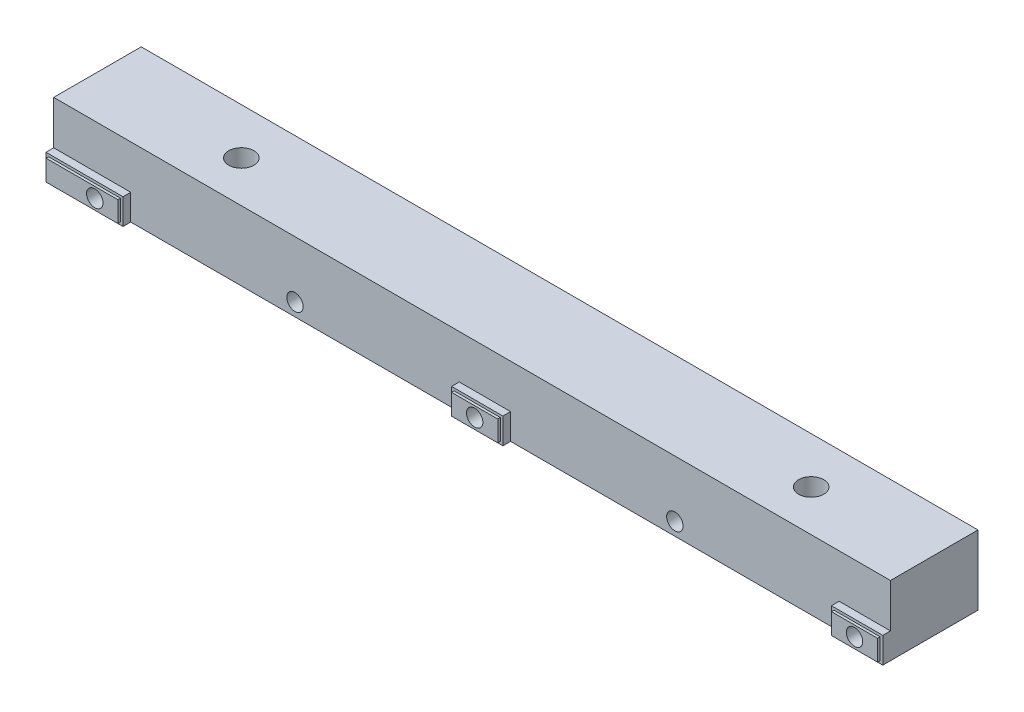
from build123d import *

# Parameters (mm, degrees)
SKETCH1_W                                       = 416
SKETCH1_H                                       = 17.05
EXTRUDE1_DEPTH                                  = 13.54
EXTRUDE2_REACH                                  = 210.614
SKETCH2_R                                       = 2.413
SKETCH3_W                                       = 10
SKETCH3_H                                       = 5.03
EXTRUDE3_DEPTH                                  = 2
LPATTERN1_COUNT                                 = 4
LPATTERN1_PITCH                                 = 37
SKETCH4_W                                       = 15
SKETCH4_H                                       = 5.03
EXTRUDE4_DEPTH                                  = 2
MIRROR1_COPY_1_SKETCH_W                         = 10
MIRROR1_COPY_1_SKETCH_H                         = 5.03
MIRROR1_COPY_1_DEPTH                            = 2
MIRROR1_COPY_2_SKETCH_W                         = 10
MIRROR1_COPY_2_SKETCH_H                         = 5.03
MIRROR1_COPY_2_DEPTH                            = 2
MIRROR1_COPY_3_SKETCH_W                         = 10
MIRROR1_COPY_3_SKETCH_H                         = 5.03
MIRROR1_COPY_3_DEPTH                            = 2
F_3_2_3_2_DIAMETER_HOLE1_D                      = 3.2
F_3_2_3_2_DIAMETER_HOLE1_CSINK_D                = 3.4
F_3_2_3_2_DIAMETER_HOLE1_CSINK_ANGLE            = 90
LPATTERN2_COUNT                                 = 5
LPATTERN2_PITCH                                 = 37
MIRROR2_COPY_1_D                                = 3.2
MIRROR2_COPY_1_CSINK_D                          = 3.4
MIRROR2_COPY_1_CSINK_ANGLE                      = 90
MIRROR2_COPY_2_D                                = 3.2
MIRROR2_COPY_2_CSINK_D                          = 3.4
MIRROR2_COPY_2_CSINK_ANGLE                      = 90
MIRROR2_COPY_3_D                                = 3.2
MIRROR2_COPY_3_CSINK_D                          = 3.4
MIRROR2_COPY_3_CSINK_ANGLE                      = 90
MIRROR2_COPY_4_D                                = 3.2
MIRROR2_COPY_4_CSINK_D                          = 3.4
MIRROR2_COPY_4_CSINK_ANGLE                      = 90
SKETCH5_W                                       = 10
SKETCH5_H                                       = 5.03
SKETCH5_W_2                                     = 9
SKETCH5_H_2                                     = 4.03
SKETCH5_W_3                                     = 15
SKETCH5_W_4                                     = 14
EXTRUDE6_DEPTH                                  = 0.5
CBORE_FOR_10_SOCKET_HEAD_CAP_SCREW1_D           = 4.9784
CBORE_FOR_10_SOCKET_HEAD_CAP_SCREW1_CBORE_D     = 9.525
CBORE_FOR_10_SOCKET_HEAD_CAP_SCREW1_CBORE_DEPTH = 4.826
EXTRUDE17_DEPTH                                 = 209.705791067
EXTRUDE17_DEPTH_BACK                            = 209.705791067
F_10_0_1935_DIAMETER_HOLE1_D                    = 4.9149
F_10_0_1935_DIAMETER_HOLE1_CSINK_D              = 5.588
F_10_0_1935_DIAMETER_HOLE1_CSINK_ANGLE          = 90
SKETCH21_W                                      = 10
SKETCH21_H                                      = 5.03
EXTRUDE18_DEPTH                                 = 210.136400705


with BuildPart() as part:
    # Sketch1 → Extrude1 (new body)
    with BuildSketch(Plane(origin=(0, 0, 0), x_dir=(1, 0, 0), z_dir=(0, 1, 0))):
        Rectangle(SKETCH1_W, SKETCH1_H)
    extrude(amount=EXTRUDE1_DEPTH)

    # Sketch2 → Extrude2 (cut, up to next)
    with BuildSketch(Plane(origin=(0, 13.54, 0), x_dir=(1, 0, 0), z_dir=(0, 1, 0)), mode=Mode.PRIVATE) as extrude2_sk1:
        with Locations(Location((0, -6.025, 0), (0, 0, 270))):
            Circle(SKETCH2_R)
    extrude2_tool1 = extrude(extrude2_sk1.sketch, amount=-EXTRUDE2_REACH, mode=Mode.PRIVATE) & part.part
    add(extrude2_tool1.solids().sort_by_distance((0, 13.54, 6.025))[0], mode=Mode.SUBTRACT)

    # Sketch3 → Extrude3 (add)
    with BuildSketch(Plane.XY.offset(8.525)):
        with Locations((-161, 2.515)):
            Rectangle(SKETCH3_W, SKETCH3_H)
    extrude3 = extrude(amount=EXTRUDE3_DEPTH)

    # LPattern1: Extrude3 ×4
    with Locations(*[(i * LPATTERN1_PITCH, 0, 0) for i in range(1, LPATTERN1_COUNT)]):
        add(extrude3)

    # Sketch4 → Extrude4 (add)
    with BuildSketch(Plane.XY.offset(8.525)):
        with Locations((-200.5, 2.515)):
            Rectangle(SKETCH4_W, SKETCH4_H)
    extrude4 = extrude(amount=EXTRUDE4_DEPTH)

    # Mirror1: Extrude3, Extrude4 across plane
    add(extrude3.mirror(Plane(origin=(0, 0, 0), x_dir=(0, 0, 1), z_dir=(1, 0, 0))))
    add(extrude4.mirror(Plane(origin=(0, 0, 0), x_dir=(0, 0, 1), z_dir=(1, 0, 0))))

    # Mirror1 copy 1 sketch → Mirror1 copy 1 (add)
    with BuildSketch(Plane(origin=(-37, 0, 8.525), x_dir=(-1, 0, 0), z_dir=(0, 0, 1))):
        with Locations((-161, -2.515)):
            Rectangle(MIRROR1_COPY_1_SKETCH_W, MIRROR1_COPY_1_SKETCH_H)
    extrude(amount=MIRROR1_COPY_1_DEPTH)

    # Mirror1 copy 2 sketch → Mirror1 copy 2 (add)
    with BuildSketch(Plane(origin=(-74, 0, 8.525), x_dir=(-1, 0, 0), z_dir=(0, 0, 1))):
        with Locations((-161, -2.515)):
            Rectangle(MIRROR1_COPY_2_SKETCH_W, MIRROR1_COPY_2_SKETCH_H)
    extrude(amount=MIRROR1_COPY_2_DEPTH)

    # Mirror1 copy 3 sketch → Mirror1 copy 3 (add)
    with BuildSketch(Plane(origin=(-111, 0, 8.525), x_dir=(-1, 0, 0), z_dir=(0, 0, 1))):
        with Locations((-161, -2.515)):
            Rectangle(MIRROR1_COPY_3_SKETCH_W, MIRROR1_COPY_3_SKETCH_H)
    extrude(amount=MIRROR1_COPY_3_DEPTH)

    # 3.2 _3.2_ Diameter Hole1 (through all)
    with Locations(Plane(origin=(198, 2.515, -8.525), x_dir=(-1, 0, 0), z_dir=(0, 0, -1))):
        with Locations((0, 0)):
            f_3_2_3_2_diameter_hole1 = CounterSinkHole(F_3_2_3_2_DIAMETER_HOLE1_D / 2, F_3_2_3_2_DIAMETER_HOLE1_CSINK_D / 2, counter_sink_angle=F_3_2_3_2_DIAMETER_HOLE1_CSINK_ANGLE)

    # LPattern2: 3.2 _3.2_ Diameter Hole1 ×5
    with Locations(*[(-i * LPATTERN2_PITCH, 0, 0) for i in range(1, LPATTERN2_COUNT)]):
        add(f_3_2_3_2_diameter_hole1, mode=Mode.SUBTRACT)

    # Mirror2: 3.2 _3.2_ Diameter Hole1 across plane
    add(f_3_2_3_2_diameter_hole1.mirror(Plane(origin=(0, 0, 0), x_dir=(0, 0, 1), z_dir=(1, 0, 0))), mode=Mode.SUBTRACT)

    # Mirror2 copy 1 (through all)
    with Locations(Plane(origin=(-161, 2.515, -8.525), x_dir=(1, 0, 0), z_dir=(0, 0, -1))):
        with Locations((0, 0)):
            CounterSinkHole(MIRROR2_COPY_1_D / 2, MIRROR2_COPY_1_CSINK_D / 2, counter_sink_angle=MIRROR2_COPY_1_CSINK_ANGLE)

    # Mirror2 copy 2 (through all)
    with Locations(Plane(origin=(-124, 2.515, -8.525), x_dir=(1, 0, 0), z_dir=(0, 0, -1))):
        with Locations((0, 0)):
            CounterSinkHole(MIRROR2_COPY_2_D / 2, MIRROR2_COPY_2_CSINK_D / 2, counter_sink_angle=MIRROR2_COPY_2_CSINK_ANGLE)

    # Mirror2 copy 3 (through all)
    with Locations(Plane(origin=(-87, 2.515, -8.525), x_dir=(1, 0, 0), z_dir=(0, 0, -1))):
        with Locations((0, 0)):
            CounterSinkHole(MIRROR2_COPY_3_D / 2, MIRROR2_COPY_3_CSINK_D / 2, counter_sink_angle=MIRROR2_COPY_3_CSINK_ANGLE)

    # Mirror2 copy 4 (through all)
    with Locations(Plane(origin=(-50, 2.515, -8.525), x_dir=(1, 0, 0), z_dir=(0, 0, -1))):
        with Locations((0, 0)):
            CounterSinkHole(MIRROR2_COPY_4_D / 2, MIRROR2_COPY_4_CSINK_D / 2, counter_sink_angle=MIRROR2_COPY_4_CSINK_ANGLE)

    # Sketch5 → Extrude6 (cut)
    # profile 1 of 10: a face of its own
    with BuildSketch(Plane.XY.offset(10.525)):
        with Locations((50, 2.515)):
            Rectangle(SKETCH5_W, SKETCH5_H)
        with Locations((50, 2.515)):
            Rectangle(SKETCH5_W_2, SKETCH5_H_2, mode=Mode.SUBTRACT)
    # profile 2 of 10: a face of its own
    with BuildSketch(Plane.XY.offset(10.525)):
        with Locations((-50, 2.515)):
            Rectangle(SKETCH5_W, SKETCH5_H)
        with Locations((-50, 2.515)):
            Rectangle(SKETCH5_W_2, SKETCH5_H_2, mode=Mode.SUBTRACT)
    # profile 3 of 10: a face of its own
    with BuildSketch(Plane.XY.offset(10.525)):
        with Locations((-87, 2.515)):
            Rectangle(SKETCH5_W, SKETCH5_H)
        with Locations((-87, 2.515)):
            Rectangle(SKETCH5_W_2, SKETCH5_H_2, mode=Mode.SUBTRACT)
    # profile 4 of 10: a face of its own
    with BuildSketch(Plane.XY.offset(10.525)):
        with Locations((-124, 2.515)):
            Rectangle(SKETCH5_W, SKETCH5_H)
        with Locations((-124, 2.515)):
            Rectangle(SKETCH5_W_2, SKETCH5_H_2, mode=Mode.SUBTRACT)
    # profile 5 of 10: a face of its own
    with BuildSketch(Plane.XY.offset(10.525)):
        with Locations((-161, 2.515)):
            Rectangle(SKETCH5_W, SKETCH5_H)
        with Locations((-161, 2.515)):
            Rectangle(SKETCH5_W_2, SKETCH5_H_2, mode=Mode.SUBTRACT)
    # profile 6 of 10: a face of its own
    with BuildSketch(Plane.XY.offset(10.525)):
        with Locations((-200.5, 2.515)):
            Rectangle(SKETCH5_W_3, SKETCH5_H)
        with Locations((-200.5, 2.515)):
            Rectangle(SKETCH5_W_4, SKETCH5_H_2, mode=Mode.SUBTRACT)
    # profile 7 of 10: a face of its own
    with BuildSketch(Plane.XY.offset(10.525)):
        with Locations((87, 2.515)):
            Rectangle(SKETCH5_W, SKETCH5_H)
        with Locations((87, 2.515)):
            Rectangle(SKETCH5_W_2, SKETCH5_H_2, mode=Mode.SUBTRACT)
    # profile 8 of 10: a face of its own
    with BuildSketch(Plane.XY.offset(10.525)):
        with Locations((124, 2.515)):
            Rectangle(SKETCH5_W, SKETCH5_H)
        with Locations((124, 2.515)):
            Rectangle(SKETCH5_W_2, SKETCH5_H_2, mode=Mode.SUBTRACT)
    # profile 9 of 10: a face of its own
    with BuildSketch(Plane.XY.offset(10.525)):
        with Locations((161, 2.515)):
            Rectangle(SKETCH5_W, SKETCH5_H)
        with Locations((161, 2.515)):
            Rectangle(SKETCH5_W_2, SKETCH5_H_2, mode=Mode.SUBTRACT)
    # profile 10 of 10: a face of its own
    with BuildSketch(Plane.XY.offset(10.525)):
        with Locations((200.5, 2.515)):
            Rectangle(SKETCH5_W_3, SKETCH5_H)
        with Locations((200.5, 2.515)):
            Rectangle(SKETCH5_W_4, SKETCH5_H_2, mode=Mode.SUBTRACT)
    extrude(amount=-EXTRUDE6_DEPTH, mode=Mode.SUBTRACT)

    # CBORE for _10 Socket Head Cap Screw1 (through all)
    with Locations(Plane(origin=(0, 0, 6.025), x_dir=(0, 0, -1), z_dir=(0, -1, 0))):
        with Locations((0, 0)):
            CounterBoreHole(CBORE_FOR_10_SOCKET_HEAD_CAP_SCREW1_D / 2, CBORE_FOR_10_SOCKET_HEAD_CAP_SCREW1_CBORE_D / 2, CBORE_FOR_10_SOCKET_HEAD_CAP_SCREW1_CBORE_DEPTH)

    # Sketch19 → Extrude17 (cut, two sides: drawn at the far end of the back side and taken through both)
    with BuildSketch(Plane.XZ.offset(-EXTRUDE17_DEPTH_BACK)):
        Polygon((-45, 525.957369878), (-45, 8.525), (-45, -8.525), (-45, -525.957369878), (989.864739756, -525.957369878), (989.864739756, 525.957369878), align=None)
    extrude(amount=EXTRUDE17_DEPTH + EXTRUDE17_DEPTH_BACK, mode=Mode.SUBTRACT)

    # 10 _0.1935_ Diameter Hole1 (through all)
    with Locations(Plane(origin=(-179.5, 0, 0.475), x_dir=(0, 0, -1), z_dir=(0, -1, 0))):
        with Locations((0, 0), (0, 111)):
            CounterSinkHole(F_10_0_1935_DIAMETER_HOLE1_D / 2, F_10_0_1935_DIAMETER_HOLE1_CSINK_D / 2, counter_sink_angle=F_10_0_1935_DIAMETER_HOLE1_CSINK_ANGLE)

    # Sketch21 → Extrude18 (cut, through all)
    with BuildSketch(Plane.XY.offset(8.525)):
        with Locations((-87, 2.515)):
            Rectangle(SKETCH21_W, SKETCH21_H)
        with Locations((-161, 2.515)):
            Rectangle(SKETCH21_W, SKETCH21_H)
    extrude(amount=EXTRUDE18_DEPTH, mode=Mode.SUBTRACT)


solid = part.part
